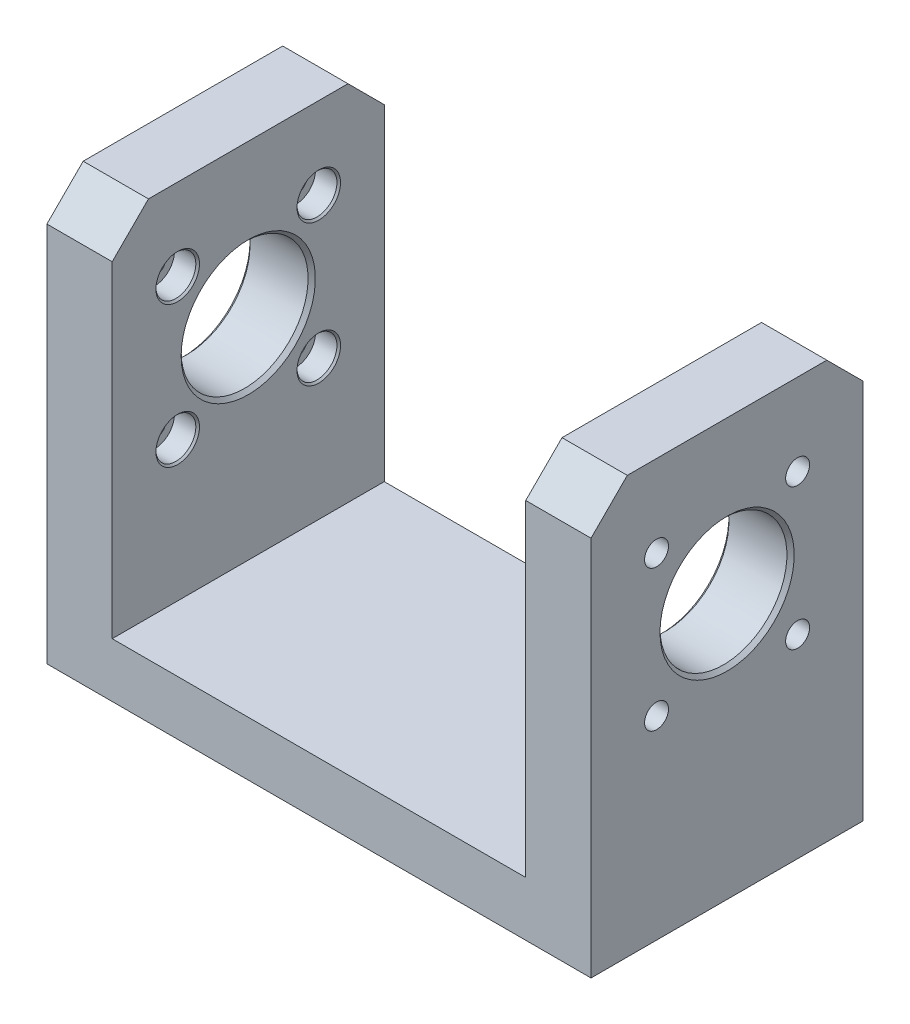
ISO-10303-21;
HEADER;
FILE_DESCRIPTION(('STEP AP214'),'2;1');
FILE_NAME('part.step','',(''),(''),'','','');
FILE_SCHEMA(('AUTOMOTIVE_DESIGN { 1 0 10303 214 1 1 1 1 }'));
ENDSEC;
DATA;
#1=APPLICATION_CONTEXT('core data for automotive mechanical design processes');
#2=APPLICATION_PROTOCOL_DEFINITION('international standard','automotive_design',2000,#1);
#3=PRODUCT_CONTEXT('',#1,'mechanical');
#4=PRODUCT('Part','Part','',(#3));
#5=PRODUCT_RELATED_PRODUCT_CATEGORY('part','',(#4));
#6=PRODUCT_DEFINITION_FORMATION('','',#4);
#7=PRODUCT_DEFINITION_CONTEXT('part definition',#1,'design');
#8=PRODUCT_DEFINITION('design','',#6,#7);
#9=PRODUCT_DEFINITION_SHAPE('','',#8);
#10=(LENGTH_UNIT() NAMED_UNIT(*) SI_UNIT(.MILLI.,.METRE.));
#11=(NAMED_UNIT(*) PLANE_ANGLE_UNIT() SI_UNIT($,.RADIAN.));
#12=(NAMED_UNIT(*) SI_UNIT($,.STERADIAN.) SOLID_ANGLE_UNIT());
#13=UNCERTAINTY_MEASURE_WITH_UNIT(LENGTH_MEASURE(1.E-05),#10,'distance_accuracy_value','');
#14=(GEOMETRIC_REPRESENTATION_CONTEXT(3) GLOBAL_UNCERTAINTY_ASSIGNED_CONTEXT((#13)) GLOBAL_UNIT_ASSIGNED_CONTEXT((#10,
#11,#12)) REPRESENTATION_CONTEXT('',''));
#15=CARTESIAN_POINT('',(0.,0.,0.));
#16=DIRECTION('',(0.,0.,1.));
#17=DIRECTION('',(1.,0.,0.));
#18=AXIS2_PLACEMENT_3D('',#15,#16,#17);
#19=CARTESIAN_POINT('',(75.,15.,37.5));
#20=DIRECTION('',(-1.,0.,0.));
#21=DIRECTION('',(0.,0.,1.));
#22=AXIS2_PLACEMENT_3D('',#19,#20,#21);
#23=PLANE('',#22);
#24=CARTESIAN_POINT('',(75.,73.,0.));
#25=DIRECTION('',(-1.,0.,0.));
#26=DIRECTION('',(0.,0.,1.));
#27=AXIS2_PLACEMENT_3D('',#24,#25,#26);
#28=CIRCLE('',#27,18.5000000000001);
#29=CARTESIAN_POINT('',(75.,73.,18.5000000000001));
#30=VERTEX_POINT('',#29);
#31=EDGE_CURVE('E394',#30,#30,#28,.T.);
#32=ORIENTED_EDGE('',*,*,#31,.T.);
#33=EDGE_LOOP('',(#32));
#34=FACE_BOUND('',#33,.T.);
#35=CARTESIAN_POINT('',(75.,53.5545635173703,-19.4454364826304));
#36=DIRECTION('',(-1.,0.,0.));
#37=DIRECTION('',(0.,0.,1.));
#38=AXIS2_PLACEMENT_3D('',#35,#36,#37);
#39=CIRCLE('',#38,3.3);
#40=CARTESIAN_POINT('',(75.,53.5545635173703,-16.1454364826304));
#41=VERTEX_POINT('',#40);
#42=EDGE_CURVE('E378',#41,#41,#39,.T.);
#43=ORIENTED_EDGE('',*,*,#42,.T.);
#44=EDGE_LOOP('',(#43));
#45=FACE_BOUND('',#44,.T.);
#46=CARTESIAN_POINT('',(75.,53.5545635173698,19.44543648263));
#47=DIRECTION('',(-1.,0.,0.));
#48=DIRECTION('',(0.,0.,1.));
#49=AXIS2_PLACEMENT_3D('',#46,#47,#48);
#50=CIRCLE('',#49,3.3);
#51=CARTESIAN_POINT('',(75.,53.5545635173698,22.74543648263));
#52=VERTEX_POINT('',#51);
#53=EDGE_CURVE('E543',#52,#52,#50,.T.);
#54=ORIENTED_EDGE('',*,*,#53,.T.);
#55=EDGE_LOOP('',(#54));
#56=FACE_BOUND('',#55,.T.);
#57=CARTESIAN_POINT('',(75.,92.4454364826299,19.4454364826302));
#58=DIRECTION('',(-1.,0.,0.));
#59=DIRECTION('',(0.,0.,1.));
#60=AXIS2_PLACEMENT_3D('',#57,#58,#59);
#61=CIRCLE('',#60,3.30000000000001);
#62=CARTESIAN_POINT('',(75.,92.4454364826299,22.7454364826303));
#63=VERTEX_POINT('',#62);
#64=EDGE_CURVE('E528',#63,#63,#61,.T.);
#65=ORIENTED_EDGE('',*,*,#64,.T.);
#66=EDGE_LOOP('',(#65));
#67=FACE_BOUND('',#66,.T.);
#68=CARTESIAN_POINT('',(75.,92.4454364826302,-19.4454364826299));
#69=DIRECTION('',(-1.,0.,0.));
#70=DIRECTION('',(0.,0.,1.));
#71=AXIS2_PLACEMENT_3D('',#68,#69,#70);
#72=CIRCLE('',#71,3.30000000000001);
#73=CARTESIAN_POINT('',(75.,92.4454364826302,-16.1454364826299));
#74=VERTEX_POINT('',#73);
#75=EDGE_CURVE('E506',#74,#74,#72,.T.);
#76=ORIENTED_EDGE('',*,*,#75,.T.);
#77=EDGE_LOOP('',(#76));
#78=FACE_BOUND('',#77,.T.);
#79=DIRECTION('',(0.,-1.,0.));
#80=VECTOR('',#79,1.);
#81=CARTESIAN_POINT('',(75.,15.,-37.5));
#82=LINE('',#81,#80);
#83=CARTESIAN_POINT('',(75.,105.,-37.5));
#84=VERTEX_POINT('',#83);
#85=CARTESIAN_POINT('',(75.,0.,-37.5));
#86=VERTEX_POINT('',#85);
#87=EDGE_CURVE('E315',#84,#86,#82,.T.);
#88=ORIENTED_EDGE('',*,*,#87,.F.);
#89=DIRECTION('',(0.,0.707106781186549,0.707106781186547));
#90=VECTOR('',#89,1.);
#91=CARTESIAN_POINT('',(75.,105.,-37.5));
#92=LINE('',#91,#90);
#93=CARTESIAN_POINT('',(75.,115.,-27.5));
#94=VERTEX_POINT('',#93);
#95=EDGE_CURVE('E415',#84,#94,#92,.T.);
#96=ORIENTED_EDGE('',*,*,#95,.T.);
#97=DIRECTION('',(0.,0.,1.));
#98=VECTOR('',#97,1.);
#99=CARTESIAN_POINT('',(75.,115.,-37.5));
#100=LINE('',#99,#98);
#101=CARTESIAN_POINT('',(75.,115.,27.5000000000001));
#102=VERTEX_POINT('',#101);
#103=EDGE_CURVE('E420',#94,#102,#100,.T.);
#104=ORIENTED_EDGE('',*,*,#103,.T.);
#105=DIRECTION('',(0.,-0.707106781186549,0.707106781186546));
#106=VECTOR('',#105,1.);
#107=CARTESIAN_POINT('',(75.,105.,37.5));
#108=LINE('',#107,#106);
#109=CARTESIAN_POINT('',(75.,105.,37.5));
#110=VERTEX_POINT('',#109);
#111=EDGE_CURVE('E404',#102,#110,#108,.T.);
#112=ORIENTED_EDGE('',*,*,#111,.T.);
#113=DIRECTION('',(0.,-1.,0.));
#114=VECTOR('',#113,1.);
#115=CARTESIAN_POINT('',(75.,15.,37.5));
#116=LINE('',#115,#114);
#117=CARTESIAN_POINT('',(75.,0.,37.5));
#118=VERTEX_POINT('',#117);
#119=EDGE_CURVE('E318',#110,#118,#116,.T.);
#120=ORIENTED_EDGE('',*,*,#119,.T.);
#121=DIRECTION('',(0.,0.,-1.));
#122=VECTOR('',#121,1.);
#123=CARTESIAN_POINT('',(75.,0.,37.5));
#124=LINE('',#123,#122);
#125=EDGE_CURVE('E306',#118,#86,#124,.T.);
#126=ORIENTED_EDGE('',*,*,#125,.T.);
#127=EDGE_LOOP('',(#88,#96,#104,#112,#120,#126));
#128=FACE_BOUND('',#127,.T.);
#129=ADVANCED_FACE('F45',(#34,#45,#56,#67,#78,#128),#23,.F.);
#130=CARTESIAN_POINT('',(57.,115.,-37.5));
#131=DIRECTION('',(-1.,0.,0.));
#132=DIRECTION('',(0.,0.,1.));
#133=AXIS2_PLACEMENT_3D('',#130,#131,#132);
#134=PLANE('',#133);
#135=CARTESIAN_POINT('',(57.,73.,0.));
#136=DIRECTION('',(-1.,0.,0.));
#137=DIRECTION('',(0.,0.,1.));
#138=AXIS2_PLACEMENT_3D('',#135,#136,#137);
#139=CIRCLE('',#138,18.5);
#140=CARTESIAN_POINT('',(57.,73.,18.5));
#141=VERTEX_POINT('',#140);
#142=EDGE_CURVE('E11',#141,#141,#139,.F.);
#143=ORIENTED_EDGE('',*,*,#142,.T.);
#144=EDGE_LOOP('',(#143));
#145=FACE_BOUND('',#144,.T.);
#146=CARTESIAN_POINT('',(57.,53.5545635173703,-19.4454364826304));
#147=DIRECTION('',(-1.,0.,0.));
#148=DIRECTION('',(0.,0.,1.));
#149=AXIS2_PLACEMENT_3D('',#146,#147,#148);
#150=CIRCLE('',#149,6.);
#151=CARTESIAN_POINT('',(57.,53.5545635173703,-13.4454364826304));
#152=VERTEX_POINT('',#151);
#153=EDGE_CURVE('E380',#152,#152,#150,.T.);
#154=ORIENTED_EDGE('',*,*,#153,.F.);
#155=EDGE_LOOP('',(#154));
#156=FACE_BOUND('',#155,.T.);
#157=CARTESIAN_POINT('',(57.,53.5545635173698,19.4454364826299));
#158=DIRECTION('',(-1.,0.,0.));
#159=DIRECTION('',(0.,0.,1.));
#160=AXIS2_PLACEMENT_3D('',#157,#158,#159);
#161=CIRCLE('',#160,6.);
#162=CARTESIAN_POINT('',(57.,53.5545635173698,25.4454364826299));
#163=VERTEX_POINT('',#162);
#164=EDGE_CURVE('E392',#163,#163,#161,.T.);
#165=ORIENTED_EDGE('',*,*,#164,.F.);
#166=EDGE_LOOP('',(#165));
#167=FACE_BOUND('',#166,.T.);
#168=CARTESIAN_POINT('',(57.,92.4454364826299,19.4454364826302));
#169=DIRECTION('',(-1.,0.,0.));
#170=DIRECTION('',(0.,0.,1.));
#171=AXIS2_PLACEMENT_3D('',#168,#169,#170);
#172=CIRCLE('',#171,6.00000000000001);
#173=CARTESIAN_POINT('',(57.,92.4454364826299,25.4454364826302));
#174=VERTEX_POINT('',#173);
#175=EDGE_CURVE('E540',#174,#174,#172,.T.);
#176=ORIENTED_EDGE('',*,*,#175,.F.);
#177=EDGE_LOOP('',(#176));
#178=FACE_BOUND('',#177,.T.);
#179=CARTESIAN_POINT('',(57.,92.4454364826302,-19.4454364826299));
#180=DIRECTION('',(-1.,0.,0.));
#181=DIRECTION('',(0.,0.,1.));
#182=AXIS2_PLACEMENT_3D('',#179,#180,#181);
#183=CIRCLE('',#182,6.00000000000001);
#184=CARTESIAN_POINT('',(57.,92.4454364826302,-13.4454364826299));
#185=VERTEX_POINT('',#184);
#186=EDGE_CURVE('E525',#185,#185,#183,.T.);
#187=ORIENTED_EDGE('',*,*,#186,.F.);
#188=EDGE_LOOP('',(#187));
#189=FACE_BOUND('',#188,.T.);
#190=DIRECTION('',(0.,0.,-1.));
#191=VECTOR('',#190,1.);
#192=CARTESIAN_POINT('',(57.,115.,-37.5));
#193=LINE('',#192,#191);
#194=CARTESIAN_POINT('',(57.,115.,27.5000000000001));
#195=VERTEX_POINT('',#194);
#196=CARTESIAN_POINT('',(57.,115.,-27.5));
#197=VERTEX_POINT('',#196);
#198=EDGE_CURVE('E505',#195,#197,#193,.T.);
#199=ORIENTED_EDGE('',*,*,#198,.T.);
#200=DIRECTION('',(0.,-0.707106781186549,-0.707106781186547));
#201=VECTOR('',#200,1.);
#202=CARTESIAN_POINT('',(57.,110.,-32.4999999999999));
#203=LINE('',#202,#201);
#204=CARTESIAN_POINT('',(57.,105.,-37.5));
#205=VERTEX_POINT('',#204);
#206=EDGE_CURVE('E405',#197,#205,#203,.T.);
#207=ORIENTED_EDGE('',*,*,#206,.T.);
#208=DIRECTION('',(0.,-1.,0.));
#209=VECTOR('',#208,1.);
#210=CARTESIAN_POINT('',(57.,115.,-37.5));
#211=LINE('',#210,#209);
#212=CARTESIAN_POINT('',(57.,15.,-37.5));
#213=VERTEX_POINT('',#212);
#214=EDGE_CURVE('E162',#205,#213,#211,.T.);
#215=ORIENTED_EDGE('',*,*,#214,.T.);
#216=DIRECTION('',(0.,0.,-1.));
#217=VECTOR('',#216,1.);
#218=CARTESIAN_POINT('',(57.,15.,-37.5));
#219=LINE('',#218,#217);
#220=CARTESIAN_POINT('',(57.,15.,37.5));
#221=VERTEX_POINT('',#220);
#222=EDGE_CURVE('E503',#221,#213,#219,.T.);
#223=ORIENTED_EDGE('',*,*,#222,.F.);
#224=DIRECTION('',(0.,-1.,0.));
#225=VECTOR('',#224,1.);
#226=CARTESIAN_POINT('',(57.,115.,37.5));
#227=LINE('',#226,#225);
#228=CARTESIAN_POINT('',(57.,105.,37.5));
#229=VERTEX_POINT('',#228);
#230=EDGE_CURVE('E363',#229,#221,#227,.T.);
#231=ORIENTED_EDGE('',*,*,#230,.F.);
#232=DIRECTION('',(0.,0.707106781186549,-0.707106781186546));
#233=VECTOR('',#232,1.);
#234=CARTESIAN_POINT('',(57.,147.5,-4.99999999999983));
#235=LINE('',#234,#233);
#236=EDGE_CURVE('E61',#229,#195,#235,.T.);
#237=ORIENTED_EDGE('',*,*,#236,.T.);
#238=EDGE_LOOP('',(#199,#207,#215,#223,#231,#237));
#239=FACE_BOUND('',#238,.T.);
#240=ADVANCED_FACE('F436',(#145,#156,#167,#178,#189,#239),#134,.T.);
#241=CARTESIAN_POINT('',(-75.,15.,37.5));
#242=DIRECTION('',(1.,0.,0.));
#243=DIRECTION('',(0.,0.,-1.));
#244=AXIS2_PLACEMENT_3D('',#241,#242,#243);
#245=PLANE('',#244);
#246=CARTESIAN_POINT('',(-75.,73.,0.));
#247=DIRECTION('',(1.,0.,0.));
#248=DIRECTION('',(0.,0.,-1.));
#249=AXIS2_PLACEMENT_3D('',#246,#247,#248);
#250=CIRCLE('',#249,18.5000000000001);
#251=CARTESIAN_POINT('',(-75.,73.,-18.5000000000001));
#252=VERTEX_POINT('',#251);
#253=EDGE_CURVE('E288',#252,#252,#250,.T.);
#254=ORIENTED_EDGE('',*,*,#253,.T.);
#255=EDGE_LOOP('',(#254));
#256=FACE_BOUND('',#255,.T.);
#257=CARTESIAN_POINT('',(-75.,53.5545635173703,-19.4454364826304));
#258=DIRECTION('',(1.,0.,0.));
#259=DIRECTION('',(0.,0.,-1.));
#260=AXIS2_PLACEMENT_3D('',#257,#258,#259);
#261=CIRCLE('',#260,3.3);
#262=CARTESIAN_POINT('',(-75.,53.5545635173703,-22.7454364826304));
#263=VERTEX_POINT('',#262);
#264=EDGE_CURVE('E180',#263,#263,#261,.T.);
#265=ORIENTED_EDGE('',*,*,#264,.T.);
#266=EDGE_LOOP('',(#265));
#267=FACE_BOUND('',#266,.T.);
#268=CARTESIAN_POINT('',(-75.,53.5545635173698,19.44543648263));
#269=DIRECTION('',(1.,0.,0.));
#270=DIRECTION('',(0.,0.,-1.));
#271=AXIS2_PLACEMENT_3D('',#268,#269,#270);
#272=CIRCLE('',#271,3.3);
#273=CARTESIAN_POINT('',(-75.,53.5545635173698,16.1454364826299));
#274=VERTEX_POINT('',#273);
#275=EDGE_CURVE('E199',#274,#274,#272,.T.);
#276=ORIENTED_EDGE('',*,*,#275,.T.);
#277=EDGE_LOOP('',(#276));
#278=FACE_BOUND('',#277,.T.);
#279=CARTESIAN_POINT('',(-75.,92.4454364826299,19.4454364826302));
#280=DIRECTION('',(1.,0.,0.));
#281=DIRECTION('',(0.,0.,-1.));
#282=AXIS2_PLACEMENT_3D('',#279,#280,#281);
#283=CIRCLE('',#282,3.30000000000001);
#284=CARTESIAN_POINT('',(-75.,92.4454364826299,16.1454364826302));
#285=VERTEX_POINT('',#284);
#286=EDGE_CURVE('E215',#285,#285,#283,.T.);
#287=ORIENTED_EDGE('',*,*,#286,.T.);
#288=EDGE_LOOP('',(#287));
#289=FACE_BOUND('',#288,.T.);
#290=CARTESIAN_POINT('',(-75.,92.4454364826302,-19.4454364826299));
#291=DIRECTION('',(1.,0.,0.));
#292=DIRECTION('',(0.,0.,-1.));
#293=AXIS2_PLACEMENT_3D('',#290,#291,#292);
#294=CIRCLE('',#293,3.30000000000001);
#295=CARTESIAN_POINT('',(-75.,92.4454364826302,-22.74543648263));
#296=VERTEX_POINT('',#295);
#297=EDGE_CURVE('E232',#296,#296,#294,.T.);
#298=ORIENTED_EDGE('',*,*,#297,.T.);
#299=EDGE_LOOP('',(#298));
#300=FACE_BOUND('',#299,.T.);
#301=DIRECTION('',(0.,0.,1.));
#302=VECTOR('',#301,1.);
#303=CARTESIAN_POINT('',(-75.,115.,-37.5));
#304=LINE('',#303,#302);
#305=CARTESIAN_POINT('',(-75.,115.,-27.5));
#306=VERTEX_POINT('',#305);
#307=CARTESIAN_POINT('',(-75.,115.,27.5));
#308=VERTEX_POINT('',#307);
#309=EDGE_CURVE('E236',#306,#308,#304,.T.);
#310=ORIENTED_EDGE('',*,*,#309,.F.);
#311=DIRECTION('',(0.,-0.707106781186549,-0.707106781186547));
#312=VECTOR('',#311,1.);
#313=CARTESIAN_POINT('',(-75.,115.,-27.5));
#314=LINE('',#313,#312);
#315=CARTESIAN_POINT('',(-75.,105.,-37.5));
#316=VERTEX_POINT('',#315);
#317=EDGE_CURVE('E263',#306,#316,#314,.T.);
#318=ORIENTED_EDGE('',*,*,#317,.T.);
#319=DIRECTION('',(0.,-1.,0.));
#320=VECTOR('',#319,1.);
#321=CARTESIAN_POINT('',(-75.,15.,-37.5));
#322=LINE('',#321,#320);
#323=CARTESIAN_POINT('',(-75.,0.,-37.5));
#324=VERTEX_POINT('',#323);
#325=EDGE_CURVE('E296',#316,#324,#322,.T.);
#326=ORIENTED_EDGE('',*,*,#325,.T.);
#327=DIRECTION('',(0.,0.,1.));
#328=VECTOR('',#327,1.);
#329=CARTESIAN_POINT('',(-75.,0.,37.5));
#330=LINE('',#329,#328);
#331=CARTESIAN_POINT('',(-75.,0.,37.5));
#332=VERTEX_POINT('',#331);
#333=EDGE_CURVE('E270',#324,#332,#330,.T.);
#334=ORIENTED_EDGE('',*,*,#333,.T.);
#335=DIRECTION('',(0.,-1.,0.));
#336=VECTOR('',#335,1.);
#337=CARTESIAN_POINT('',(-75.,15.,37.5));
#338=LINE('',#337,#336);
#339=CARTESIAN_POINT('',(-75.,105.,37.5));
#340=VERTEX_POINT('',#339);
#341=EDGE_CURVE('E320',#340,#332,#338,.T.);
#342=ORIENTED_EDGE('',*,*,#341,.F.);
#343=DIRECTION('',(0.,0.707106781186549,-0.707106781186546));
#344=VECTOR('',#343,1.);
#345=CARTESIAN_POINT('',(-75.,115.,27.5000000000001));
#346=LINE('',#345,#344);
#347=EDGE_CURVE('E332',#340,#308,#346,.T.);
#348=ORIENTED_EDGE('',*,*,#347,.T.);
#349=EDGE_LOOP('',(#310,#318,#326,#334,#342,#348));
#350=FACE_BOUND('',#349,.T.);
#351=ADVANCED_FACE('F338',(#256,#267,#278,#289,#300,#350),#245,.F.);
#352=CARTESIAN_POINT('',(75.,15.,37.5));
#353=DIRECTION('',(0.,0.,-1.));
#354=DIRECTION('',(-1.,0.,0.));
#355=AXIS2_PLACEMENT_3D('',#352,#353,#354);
#356=PLANE('',#355);
#357=ORIENTED_EDGE('',*,*,#119,.F.);
#358=DIRECTION('',(-1.,0.,0.));
#359=VECTOR('',#358,1.);
#360=CARTESIAN_POINT('',(57.,105.,37.5));
#361=LINE('',#360,#359);
#362=EDGE_CURVE('E397',#110,#229,#361,.T.);
#363=ORIENTED_EDGE('',*,*,#362,.T.);
#364=ORIENTED_EDGE('',*,*,#230,.T.);
#365=DIRECTION('',(1.,0.,0.));
#366=VECTOR('',#365,1.);
#367=CARTESIAN_POINT('',(75.,15.,37.5));
#368=LINE('',#367,#366);
#369=CARTESIAN_POINT('',(-57.,15.,37.5));
#370=VERTEX_POINT('',#369);
#371=EDGE_CURVE('E251',#370,#221,#368,.T.);
#372=ORIENTED_EDGE('',*,*,#371,.F.);
#373=DIRECTION('',(0.,-1.,0.));
#374=VECTOR('',#373,1.);
#375=CARTESIAN_POINT('',(-57.,115.,37.5));
#376=LINE('',#375,#374);
#377=CARTESIAN_POINT('',(-57.,105.,37.5));
#378=VERTEX_POINT('',#377);
#379=EDGE_CURVE('E262',#378,#370,#376,.T.);
#380=ORIENTED_EDGE('',*,*,#379,.F.);
#381=DIRECTION('',(-1.,0.,0.));
#382=VECTOR('',#381,1.);
#383=CARTESIAN_POINT('',(-75.,105.,37.5));
#384=LINE('',#383,#382);
#385=EDGE_CURVE('E274',#378,#340,#384,.T.);
#386=ORIENTED_EDGE('',*,*,#385,.T.);
#387=ORIENTED_EDGE('',*,*,#341,.T.);
#388=DIRECTION('',(1.,0.,0.));
#389=VECTOR('',#388,1.);
#390=CARTESIAN_POINT('',(75.,0.,37.5));
#391=LINE('',#390,#389);
#392=EDGE_CURVE('E302',#332,#118,#391,.T.);
#393=ORIENTED_EDGE('',*,*,#392,.T.);
#394=EDGE_LOOP('',(#357,#363,#364,#372,#380,#386,#387,#393));
#395=FACE_BOUND('',#394,.T.);
#396=ADVANCED_FACE('F360',(#395),#356,.F.);
#397=CARTESIAN_POINT('',(75.,15.,-37.5));
#398=DIRECTION('',(0.,0.,1.));
#399=DIRECTION('',(1.,0.,0.));
#400=AXIS2_PLACEMENT_3D('',#397,#398,#399);
#401=PLANE('',#400);
#402=CARTESIAN_POINT('',(-61.,95.,-37.5));
#403=DIRECTION('',(0.,0.,-1.));
#404=DIRECTION('',(-1.,0.,0.));
#405=AXIS2_PLACEMENT_3D('',#402,#403,#404);
#406=CIRCLE('',#405,1.65);
#407=CARTESIAN_POINT('',(-62.65,95.,-37.5));
#408=VERTEX_POINT('',#407);
#409=EDGE_CURVE('E155',#408,#408,#406,.T.);
#410=ORIENTED_EDGE('',*,*,#409,.F.);
#411=EDGE_LOOP('',(#410));
#412=FACE_BOUND('',#411,.T.);
#413=CARTESIAN_POINT('',(-61.,25.,-37.5));
#414=DIRECTION('',(0.,0.,-1.));
#415=DIRECTION('',(-1.,0.,0.));
#416=AXIS2_PLACEMENT_3D('',#413,#414,#415);
#417=CIRCLE('',#416,1.65);
#418=CARTESIAN_POINT('',(-62.65,25.,-37.5));
#419=VERTEX_POINT('',#418);
#420=EDGE_CURVE('E154',#419,#419,#417,.T.);
#421=ORIENTED_EDGE('',*,*,#420,.F.);
#422=EDGE_LOOP('',(#421));
#423=FACE_BOUND('',#422,.T.);
#424=ORIENTED_EDGE('',*,*,#214,.F.);
#425=DIRECTION('',(1.,0.,0.));
#426=VECTOR('',#425,1.);
#427=CARTESIAN_POINT('',(75.,105.,-37.5));
#428=LINE('',#427,#426);
#429=EDGE_CURVE('E292',#205,#84,#428,.T.);
#430=ORIENTED_EDGE('',*,*,#429,.T.);
#431=ORIENTED_EDGE('',*,*,#87,.T.);
#432=DIRECTION('',(-1.,0.,0.));
#433=VECTOR('',#432,1.);
#434=CARTESIAN_POINT('',(75.,0.,-37.5));
#435=LINE('',#434,#433);
#436=EDGE_CURVE('E309',#86,#324,#435,.T.);
#437=ORIENTED_EDGE('',*,*,#436,.T.);
#438=ORIENTED_EDGE('',*,*,#325,.F.);
#439=DIRECTION('',(1.,0.,0.));
#440=VECTOR('',#439,1.);
#441=CARTESIAN_POINT('',(-57.,105.,-37.5));
#442=LINE('',#441,#440);
#443=CARTESIAN_POINT('',(-57.,105.,-37.5));
#444=VERTEX_POINT('',#443);
#445=EDGE_CURVE('E265',#316,#444,#442,.T.);
#446=ORIENTED_EDGE('',*,*,#445,.T.);
#447=DIRECTION('',(0.,-1.,0.));
#448=VECTOR('',#447,1.);
#449=CARTESIAN_POINT('',(-57.,115.,-37.5));
#450=LINE('',#449,#448);
#451=CARTESIAN_POINT('',(-57.,15.,-37.5));
#452=VERTEX_POINT('',#451);
#453=EDGE_CURVE('E242',#444,#452,#450,.T.);
#454=ORIENTED_EDGE('',*,*,#453,.T.);
#455=DIRECTION('',(-1.,0.,0.));
#456=VECTOR('',#455,1.);
#457=CARTESIAN_POINT('',(75.,15.,-37.5));
#458=LINE('',#457,#456);
#459=EDGE_CURVE('E293',#213,#452,#458,.T.);
#460=ORIENTED_EDGE('',*,*,#459,.F.);
#461=EDGE_LOOP('',(#424,#430,#431,#437,#438,#446,#454,#460));
#462=FACE_BOUND('',#461,.T.);
#463=ADVANCED_FACE('F344',(#412,#423,#462),#401,.F.);
#464=CARTESIAN_POINT('',(-75.,15.,-37.5));
#465=DIRECTION('',(0.,1.,0.));
#466=DIRECTION('',(0.,0.,1.));
#467=AXIS2_PLACEMENT_3D('',#464,#465,#466);
#468=PLANE('',#467);
#469=ORIENTED_EDGE('',*,*,#222,.T.);
#470=ORIENTED_EDGE('',*,*,#459,.T.);
#471=DIRECTION('',(0.,0.,-1.));
#472=VECTOR('',#471,1.);
#473=CARTESIAN_POINT('',(-57.,15.,-37.5));
#474=LINE('',#473,#472);
#475=EDGE_CURVE('E235',#370,#452,#474,.T.);
#476=ORIENTED_EDGE('',*,*,#475,.F.);
#477=ORIENTED_EDGE('',*,*,#371,.T.);
#478=EDGE_LOOP('',(#469,#470,#476,#477));
#479=FACE_BOUND('',#478,.T.);
#480=ADVANCED_FACE('F495',(#479),#468,.T.);
#481=CARTESIAN_POINT('',(-75.,0.,-37.5));
#482=DIRECTION('',(0.,1.,0.));
#483=DIRECTION('',(0.,0.,1.));
#484=AXIS2_PLACEMENT_3D('',#481,#482,#483);
#485=PLANE('',#484);
#486=ORIENTED_EDGE('',*,*,#333,.F.);
#487=ORIENTED_EDGE('',*,*,#436,.F.);
#488=ORIENTED_EDGE('',*,*,#125,.F.);
#489=ORIENTED_EDGE('',*,*,#392,.F.);
#490=EDGE_LOOP('',(#486,#487,#488,#489));
#491=FACE_BOUND('',#490,.T.);
#492=ADVANCED_FACE('F493',(#491),#485,.F.);
#493=CARTESIAN_POINT('',(-57.,115.,-37.5));
#494=DIRECTION('',(-1.,0.,0.));
#495=DIRECTION('',(0.,0.,1.));
#496=AXIS2_PLACEMENT_3D('',#493,#494,#495);
#497=PLANE('',#496);
#498=CARTESIAN_POINT('',(-57.,73.,0.));
#499=DIRECTION('',(-1.,0.,0.));
#500=DIRECTION('',(0.,0.,1.));
#501=AXIS2_PLACEMENT_3D('',#498,#499,#500);
#502=CIRCLE('',#501,18.5);
#503=CARTESIAN_POINT('',(-57.,73.,18.5));
#504=VERTEX_POINT('',#503);
#505=EDGE_CURVE('E284',#504,#504,#502,.T.);
#506=ORIENTED_EDGE('',*,*,#505,.T.);
#507=EDGE_LOOP('',(#506));
#508=FACE_BOUND('',#507,.T.);
#509=CARTESIAN_POINT('',(-57.,53.5545635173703,-19.4454364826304));
#510=DIRECTION('',(1.,0.,0.));
#511=DIRECTION('',(0.,0.,-1.));
#512=AXIS2_PLACEMENT_3D('',#509,#510,#511);
#513=CIRCLE('',#512,6.);
#514=CARTESIAN_POINT('',(-57.,53.5545635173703,-25.4454364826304));
#515=VERTEX_POINT('',#514);
#516=EDGE_CURVE('E168',#515,#515,#513,.T.);
#517=ORIENTED_EDGE('',*,*,#516,.F.);
#518=EDGE_LOOP('',(#517));
#519=FACE_BOUND('',#518,.T.);
#520=CARTESIAN_POINT('',(-57.,53.5545635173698,19.4454364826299));
#521=DIRECTION('',(1.,0.,0.));
#522=DIRECTION('',(0.,0.,-1.));
#523=AXIS2_PLACEMENT_3D('',#520,#521,#522);
#524=CIRCLE('',#523,6.);
#525=CARTESIAN_POINT('',(-57.,53.5545635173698,13.4454364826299));
#526=VERTEX_POINT('',#525);
#527=EDGE_CURVE('E183',#526,#526,#524,.T.);
#528=ORIENTED_EDGE('',*,*,#527,.F.);
#529=EDGE_LOOP('',(#528));
#530=FACE_BOUND('',#529,.T.);
#531=CARTESIAN_POINT('',(-57.,92.4454364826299,19.4454364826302));
#532=DIRECTION('',(1.,0.,0.));
#533=DIRECTION('',(0.,0.,-1.));
#534=AXIS2_PLACEMENT_3D('',#531,#532,#533);
#535=CIRCLE('',#534,6.00000000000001);
#536=CARTESIAN_POINT('',(-57.,92.4454364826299,13.4454364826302));
#537=VERTEX_POINT('',#536);
#538=EDGE_CURVE('E203',#537,#537,#535,.T.);
#539=ORIENTED_EDGE('',*,*,#538,.F.);
#540=EDGE_LOOP('',(#539));
#541=FACE_BOUND('',#540,.T.);
#542=CARTESIAN_POINT('',(-57.,92.4454364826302,-19.4454364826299));
#543=DIRECTION('',(1.,0.,0.));
#544=DIRECTION('',(0.,0.,-1.));
#545=AXIS2_PLACEMENT_3D('',#542,#543,#544);
#546=CIRCLE('',#545,6.00000000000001);
#547=CARTESIAN_POINT('',(-57.,92.4454364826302,-25.4454364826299));
#548=VERTEX_POINT('',#547);
#549=EDGE_CURVE('E218',#548,#548,#546,.T.);
#550=ORIENTED_EDGE('',*,*,#549,.F.);
#551=EDGE_LOOP('',(#550));
#552=FACE_BOUND('',#551,.T.);
#553=ORIENTED_EDGE('',*,*,#453,.F.);
#554=DIRECTION('',(0.,0.707106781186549,0.707106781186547));
#555=VECTOR('',#554,1.);
#556=CARTESIAN_POINT('',(-57.,115.,-27.5));
#557=LINE('',#556,#555);
#558=CARTESIAN_POINT('',(-57.,115.,-27.5));
#559=VERTEX_POINT('',#558);
#560=EDGE_CURVE('E272',#444,#559,#557,.T.);
#561=ORIENTED_EDGE('',*,*,#560,.T.);
#562=DIRECTION('',(0.,0.,-1.));
#563=VECTOR('',#562,1.);
#564=CARTESIAN_POINT('',(-57.,115.,-37.5));
#565=LINE('',#564,#563);
#566=CARTESIAN_POINT('',(-57.,115.,27.5));
#567=VERTEX_POINT('',#566);
#568=EDGE_CURVE('E239',#567,#559,#565,.T.);
#569=ORIENTED_EDGE('',*,*,#568,.F.);
#570=DIRECTION('',(0.,-0.707106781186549,0.707106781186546));
#571=VECTOR('',#570,1.);
#572=CARTESIAN_POINT('',(-57.,115.,27.5000000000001));
#573=LINE('',#572,#571);
#574=EDGE_CURVE('E267',#567,#378,#573,.T.);
#575=ORIENTED_EDGE('',*,*,#574,.T.);
#576=ORIENTED_EDGE('',*,*,#379,.T.);
#577=ORIENTED_EDGE('',*,*,#475,.T.);
#578=EDGE_LOOP('',(#553,#561,#569,#575,#576,#577));
#579=FACE_BOUND('',#578,.T.);
#580=ADVANCED_FACE('F351',(#508,#519,#530,#541,#552,#579),#497,.F.);
#581=CARTESIAN_POINT('',(-75.,115.,-37.5));
#582=DIRECTION('',(0.,1.,0.));
#583=DIRECTION('',(0.,0.,1.));
#584=AXIS2_PLACEMENT_3D('',#581,#582,#583);
#585=PLANE('',#584);
#586=ORIENTED_EDGE('',*,*,#568,.T.);
#587=DIRECTION('',(-1.,0.,0.));
#588=VECTOR('',#587,1.);
#589=CARTESIAN_POINT('',(-75.,115.,-27.5));
#590=LINE('',#589,#588);
#591=EDGE_CURVE('E327',#559,#306,#590,.T.);
#592=ORIENTED_EDGE('',*,*,#591,.T.);
#593=ORIENTED_EDGE('',*,*,#309,.T.);
#594=DIRECTION('',(1.,0.,0.));
#595=VECTOR('',#594,1.);
#596=CARTESIAN_POINT('',(-57.,115.,27.5000000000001));
#597=LINE('',#596,#595);
#598=EDGE_CURVE('E322',#308,#567,#597,.T.);
#599=ORIENTED_EDGE('',*,*,#598,.T.);
#600=EDGE_LOOP('',(#586,#592,#593,#599));
#601=FACE_BOUND('',#600,.T.);
#602=ADVANCED_FACE('F352',(#601),#585,.T.);
#603=CARTESIAN_POINT('',(75.001025,73.,0.));
#604=DIRECTION('',(-1.,0.,0.));
#605=DIRECTION('',(0.,0.,1.));
#606=AXIS2_PLACEMENT_3D('',#603,#604,#605);
#607=CYLINDRICAL_SURFACE('',#606,17.5);
#608=CARTESIAN_POINT('',(-58.,73.,0.));
#609=DIRECTION('',(-1.,0.,0.));
#610=DIRECTION('',(0.,0.,1.));
#611=AXIS2_PLACEMENT_3D('',#608,#609,#610);
#612=CIRCLE('',#611,17.5);
#613=CARTESIAN_POINT('',(-58.,73.,17.5));
#614=VERTEX_POINT('',#613);
#615=EDGE_CURVE('E280',#614,#614,#612,.F.);
#616=ORIENTED_EDGE('',*,*,#615,.T.);
#617=EDGE_LOOP('',(#616));
#618=FACE_BOUND('',#617,.T.);
#619=CARTESIAN_POINT('',(-73.9999999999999,73.,0.));
#620=DIRECTION('',(1.,0.,0.));
#621=DIRECTION('',(0.,0.,-1.));
#622=AXIS2_PLACEMENT_3D('',#619,#620,#621);
#623=CIRCLE('',#622,17.5);
#624=CARTESIAN_POINT('',(-73.9999999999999,73.,-17.5));
#625=VERTEX_POINT('',#624);
#626=EDGE_CURVE('E276',#625,#625,#623,.F.);
#627=ORIENTED_EDGE('',*,*,#626,.T.);
#628=EDGE_LOOP('',(#627));
#629=FACE_BOUND('',#628,.T.);
#630=ADVANCED_FACE('F476',(#618,#629),#607,.F.);
#631=CARTESIAN_POINT('',(-57.,92.4454364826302,-19.4454364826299));
#632=DIRECTION('',(1.,0.,0.));
#633=DIRECTION('',(0.,0.,-1.));
#634=AXIS2_PLACEMENT_3D('',#631,#632,#633);
#635=CYLINDRICAL_SURFACE('',#634,3.3);
#636=ORIENTED_EDGE('',*,*,#297,.F.);
#637=EDGE_LOOP('',(#636));
#638=FACE_BOUND('',#637,.T.);
#639=CARTESIAN_POINT('',(-63.4,92.4454364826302,-19.4454364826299));
#640=DIRECTION('',(1.,0.,0.));
#641=DIRECTION('',(0.,0.,-1.));
#642=AXIS2_PLACEMENT_3D('',#639,#640,#641);
#643=CIRCLE('',#642,3.3);
#644=CARTESIAN_POINT('',(-63.4,92.4454364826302,-22.7454364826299));
#645=VERTEX_POINT('',#644);
#646=EDGE_CURVE('E229',#645,#645,#643,.T.);
#647=ORIENTED_EDGE('',*,*,#646,.T.);
#648=EDGE_LOOP('',(#647));
#649=FACE_BOUND('',#648,.T.);
#650=ADVANCED_FACE('F478',(#638,#649),#635,.F.);
#651=CARTESIAN_POINT('',(-63.4,97.9454364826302,-19.4454364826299));
#652=DIRECTION('',(-1.,0.,0.));
#653=DIRECTION('',(0.,0.,1.));
#654=AXIS2_PLACEMENT_3D('',#651,#652,#653);
#655=PLANE('',#654);
#656=ORIENTED_EDGE('',*,*,#646,.F.);
#657=EDGE_LOOP('',(#656));
#658=FACE_BOUND('',#657,.T.);
#659=CARTESIAN_POINT('',(-63.4,92.4454364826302,-19.4454364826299));
#660=DIRECTION('',(1.,0.,0.));
#661=DIRECTION('',(0.,0.,-1.));
#662=AXIS2_PLACEMENT_3D('',#659,#660,#661);
#663=CIRCLE('',#662,5.49999999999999);
#664=CARTESIAN_POINT('',(-63.4,92.4454364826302,-24.9454364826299));
#665=VERTEX_POINT('',#664);
#666=EDGE_CURVE('E226',#665,#665,#663,.T.);
#667=ORIENTED_EDGE('',*,*,#666,.T.);
#668=EDGE_LOOP('',(#667));
#669=FACE_BOUND('',#668,.T.);
#670=ADVANCED_FACE('F485',(#658,#669),#655,.F.);
#671=CARTESIAN_POINT('',(-57.,92.4454364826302,-19.4454364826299));
#672=DIRECTION('',(1.,0.,0.));
#673=DIRECTION('',(0.,0.,-1.));
#674=AXIS2_PLACEMENT_3D('',#671,#672,#673);
#675=CYLINDRICAL_SURFACE('',#674,5.5);
#676=ORIENTED_EDGE('',*,*,#666,.F.);
#677=EDGE_LOOP('',(#676));
#678=FACE_BOUND('',#677,.T.);
#679=CARTESIAN_POINT('',(-57.5,92.4454364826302,-19.4454364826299));
#680=DIRECTION('',(1.,0.,0.));
#681=DIRECTION('',(0.,0.,-1.));
#682=AXIS2_PLACEMENT_3D('',#679,#680,#681);
#683=CIRCLE('',#682,5.50000000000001);
#684=CARTESIAN_POINT('',(-57.5,92.4454364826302,-24.9454364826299));
#685=VERTEX_POINT('',#684);
#686=EDGE_CURVE('E222',#685,#685,#683,.T.);
#687=ORIENTED_EDGE('',*,*,#686,.T.);
#688=EDGE_LOOP('',(#687));
#689=FACE_BOUND('',#688,.T.);
#690=ADVANCED_FACE('F654',(#678,#689),#675,.F.);
#691=CARTESIAN_POINT('',(-57.,92.4454364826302,-19.4454364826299));
#692=DIRECTION('',(1.,0.,0.));
#693=DIRECTION('',(0.,0.,-1.));
#694=AXIS2_PLACEMENT_3D('',#691,#692,#693);
#695=CONICAL_SURFACE('',#694,6.00000000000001,0.785398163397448);
#696=ORIENTED_EDGE('',*,*,#686,.F.);
#697=EDGE_LOOP('',(#696));
#698=FACE_BOUND('',#697,.T.);
#699=ORIENTED_EDGE('',*,*,#549,.T.);
#700=EDGE_LOOP('',(#699));
#701=FACE_BOUND('',#700,.T.);
#702=ADVANCED_FACE('F650',(#698,#701),#695,.F.);
#703=CARTESIAN_POINT('',(-57.,92.4454364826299,19.4454364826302));
#704=DIRECTION('',(1.,0.,0.));
#705=DIRECTION('',(0.,0.,-1.));
#706=AXIS2_PLACEMENT_3D('',#703,#704,#705);
#707=CYLINDRICAL_SURFACE('',#706,3.3);
#708=ORIENTED_EDGE('',*,*,#286,.F.);
#709=EDGE_LOOP('',(#708));
#710=FACE_BOUND('',#709,.T.);
#711=CARTESIAN_POINT('',(-63.4,92.4454364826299,19.4454364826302));
#712=DIRECTION('',(1.,0.,0.));
#713=DIRECTION('',(0.,0.,-1.));
#714=AXIS2_PLACEMENT_3D('',#711,#712,#713);
#715=CIRCLE('',#714,3.3);
#716=CARTESIAN_POINT('',(-63.4,92.4454364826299,16.1454364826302));
#717=VERTEX_POINT('',#716);
#718=EDGE_CURVE('E212',#717,#717,#715,.T.);
#719=ORIENTED_EDGE('',*,*,#718,.T.);
#720=EDGE_LOOP('',(#719));
#721=FACE_BOUND('',#720,.T.);
#722=ADVANCED_FACE('F646',(#710,#721),#707,.F.);
#723=CARTESIAN_POINT('',(-63.4,97.9454364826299,19.4454364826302));
#724=DIRECTION('',(-1.,0.,0.));
#725=DIRECTION('',(0.,0.,1.));
#726=AXIS2_PLACEMENT_3D('',#723,#724,#725);
#727=PLANE('',#726);
#728=ORIENTED_EDGE('',*,*,#718,.F.);
#729=EDGE_LOOP('',(#728));
#730=FACE_BOUND('',#729,.T.);
#731=CARTESIAN_POINT('',(-63.4,92.4454364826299,19.4454364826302));
#732=DIRECTION('',(1.,0.,0.));
#733=DIRECTION('',(0.,0.,-1.));
#734=AXIS2_PLACEMENT_3D('',#731,#732,#733);
#735=CIRCLE('',#734,5.49999999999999);
#736=CARTESIAN_POINT('',(-63.4,92.4454364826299,13.9454364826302));
#737=VERTEX_POINT('',#736);
#738=EDGE_CURVE('E209',#737,#737,#735,.T.);
#739=ORIENTED_EDGE('',*,*,#738,.T.);
#740=EDGE_LOOP('',(#739));
#741=FACE_BOUND('',#740,.T.);
#742=ADVANCED_FACE('F642',(#730,#741),#727,.F.);
#743=CARTESIAN_POINT('',(-57.,92.4454364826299,19.4454364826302));
#744=DIRECTION('',(1.,0.,0.));
#745=DIRECTION('',(0.,0.,-1.));
#746=AXIS2_PLACEMENT_3D('',#743,#744,#745);
#747=CYLINDRICAL_SURFACE('',#746,5.5);
#748=ORIENTED_EDGE('',*,*,#738,.F.);
#749=EDGE_LOOP('',(#748));
#750=FACE_BOUND('',#749,.T.);
#751=CARTESIAN_POINT('',(-57.5,92.4454364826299,19.4454364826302));
#752=DIRECTION('',(1.,0.,0.));
#753=DIRECTION('',(0.,0.,-1.));
#754=AXIS2_PLACEMENT_3D('',#751,#752,#753);
#755=CIRCLE('',#754,5.50000000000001);
#756=CARTESIAN_POINT('',(-57.5,92.4454364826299,13.9454364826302));
#757=VERTEX_POINT('',#756);
#758=EDGE_CURVE('E206',#757,#757,#755,.T.);
#759=ORIENTED_EDGE('',*,*,#758,.T.);
#760=EDGE_LOOP('',(#759));
#761=FACE_BOUND('',#760,.T.);
#762=ADVANCED_FACE('F638',(#750,#761),#747,.F.);
#763=CARTESIAN_POINT('',(-57.,92.4454364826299,19.4454364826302));
#764=DIRECTION('',(1.,0.,0.));
#765=DIRECTION('',(0.,0.,-1.));
#766=AXIS2_PLACEMENT_3D('',#763,#764,#765);
#767=CONICAL_SURFACE('',#766,6.00000000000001,0.785398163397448);
#768=ORIENTED_EDGE('',*,*,#758,.F.);
#769=EDGE_LOOP('',(#768));
#770=FACE_BOUND('',#769,.T.);
#771=ORIENTED_EDGE('',*,*,#538,.T.);
#772=EDGE_LOOP('',(#771));
#773=FACE_BOUND('',#772,.T.);
#774=ADVANCED_FACE('F634',(#770,#773),#767,.F.);
#775=CARTESIAN_POINT('',(-57.,53.5545635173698,19.4454364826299));
#776=DIRECTION('',(1.,0.,0.));
#777=DIRECTION('',(0.,0.,-1.));
#778=AXIS2_PLACEMENT_3D('',#775,#776,#777);
#779=CYLINDRICAL_SURFACE('',#778,3.3);
#780=ORIENTED_EDGE('',*,*,#275,.F.);
#781=EDGE_LOOP('',(#780));
#782=FACE_BOUND('',#781,.T.);
#783=CARTESIAN_POINT('',(-63.4,53.5545635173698,19.4454364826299));
#784=DIRECTION('',(1.,0.,0.));
#785=DIRECTION('',(0.,0.,-1.));
#786=AXIS2_PLACEMENT_3D('',#783,#784,#785);
#787=CIRCLE('',#786,3.3);
#788=CARTESIAN_POINT('',(-63.4,53.5545635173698,16.14543648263));
#789=VERTEX_POINT('',#788);
#790=EDGE_CURVE('E195',#789,#789,#787,.T.);
#791=ORIENTED_EDGE('',*,*,#790,.T.);
#792=EDGE_LOOP('',(#791));
#793=FACE_BOUND('',#792,.T.);
#794=ADVANCED_FACE('F630',(#782,#793),#779,.F.);
#795=CARTESIAN_POINT('',(-63.4,59.0545635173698,19.4454364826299));
#796=DIRECTION('',(-1.,0.,0.));
#797=DIRECTION('',(0.,0.,1.));
#798=AXIS2_PLACEMENT_3D('',#795,#796,#797);
#799=PLANE('',#798);
#800=ORIENTED_EDGE('',*,*,#790,.F.);
#801=EDGE_LOOP('',(#800));
#802=FACE_BOUND('',#801,.T.);
#803=CARTESIAN_POINT('',(-63.4,53.5545635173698,19.4454364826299));
#804=DIRECTION('',(1.,0.,0.));
#805=DIRECTION('',(0.,0.,-1.));
#806=AXIS2_PLACEMENT_3D('',#803,#804,#805);
#807=CIRCLE('',#806,5.5);
#808=CARTESIAN_POINT('',(-63.4,53.5545635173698,13.9454364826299));
#809=VERTEX_POINT('',#808);
#810=EDGE_CURVE('E191',#809,#809,#807,.T.);
#811=ORIENTED_EDGE('',*,*,#810,.T.);
#812=EDGE_LOOP('',(#811));
#813=FACE_BOUND('',#812,.T.);
#814=ADVANCED_FACE('F626',(#802,#813),#799,.F.);
#815=CARTESIAN_POINT('',(-57.,53.5545635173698,19.4454364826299));
#816=DIRECTION('',(1.,0.,0.));
#817=DIRECTION('',(0.,0.,-1.));
#818=AXIS2_PLACEMENT_3D('',#815,#816,#817);
#819=CYLINDRICAL_SURFACE('',#818,5.5);
#820=ORIENTED_EDGE('',*,*,#810,.F.);
#821=EDGE_LOOP('',(#820));
#822=FACE_BOUND('',#821,.T.);
#823=CARTESIAN_POINT('',(-57.5,53.5545635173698,19.4454364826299));
#824=DIRECTION('',(1.,0.,0.));
#825=DIRECTION('',(0.,0.,-1.));
#826=AXIS2_PLACEMENT_3D('',#823,#824,#825);
#827=CIRCLE('',#826,5.5);
#828=CARTESIAN_POINT('',(-57.5,53.5545635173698,13.9454364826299));
#829=VERTEX_POINT('',#828);
#830=EDGE_CURVE('E187',#829,#829,#827,.T.);
#831=ORIENTED_EDGE('',*,*,#830,.T.);
#832=EDGE_LOOP('',(#831));
#833=FACE_BOUND('',#832,.T.);
#834=ADVANCED_FACE('F622',(#822,#833),#819,.F.);
#835=CARTESIAN_POINT('',(-57.,53.5545635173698,19.4454364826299));
#836=DIRECTION('',(1.,0.,0.));
#837=DIRECTION('',(0.,0.,-1.));
#838=AXIS2_PLACEMENT_3D('',#835,#836,#837);
#839=CONICAL_SURFACE('',#838,6.,0.785398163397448);
#840=ORIENTED_EDGE('',*,*,#830,.F.);
#841=EDGE_LOOP('',(#840));
#842=FACE_BOUND('',#841,.T.);
#843=ORIENTED_EDGE('',*,*,#527,.T.);
#844=EDGE_LOOP('',(#843));
#845=FACE_BOUND('',#844,.T.);
#846=ADVANCED_FACE('F618',(#842,#845),#839,.F.);
#847=CARTESIAN_POINT('',(-57.,53.5545635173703,-19.4454364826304));
#848=DIRECTION('',(1.,0.,0.));
#849=DIRECTION('',(0.,0.,-1.));
#850=AXIS2_PLACEMENT_3D('',#847,#848,#849);
#851=CYLINDRICAL_SURFACE('',#850,3.3);
#852=ORIENTED_EDGE('',*,*,#264,.F.);
#853=EDGE_LOOP('',(#852));
#854=FACE_BOUND('',#853,.T.);
#855=CARTESIAN_POINT('',(-63.4,53.5545635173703,-19.4454364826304));
#856=DIRECTION('',(1.,0.,0.));
#857=DIRECTION('',(0.,0.,-1.));
#858=AXIS2_PLACEMENT_3D('',#855,#856,#857);
#859=CIRCLE('',#858,3.3);
#860=CARTESIAN_POINT('',(-63.4,53.5545635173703,-22.7454364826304));
#861=VERTEX_POINT('',#860);
#862=EDGE_CURVE('E177',#861,#861,#859,.T.);
#863=ORIENTED_EDGE('',*,*,#862,.T.);
#864=EDGE_LOOP('',(#863));
#865=FACE_BOUND('',#864,.T.);
#866=ADVANCED_FACE('F614',(#854,#865),#851,.F.);
#867=CARTESIAN_POINT('',(-63.4,59.0545635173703,-19.4454364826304));
#868=DIRECTION('',(-1.,0.,0.));
#869=DIRECTION('',(0.,0.,1.));
#870=AXIS2_PLACEMENT_3D('',#867,#868,#869);
#871=PLANE('',#870);
#872=ORIENTED_EDGE('',*,*,#862,.F.);
#873=EDGE_LOOP('',(#872));
#874=FACE_BOUND('',#873,.T.);
#875=CARTESIAN_POINT('',(-63.4,53.5545635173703,-19.4454364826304));
#876=DIRECTION('',(1.,0.,0.));
#877=DIRECTION('',(0.,0.,-1.));
#878=AXIS2_PLACEMENT_3D('',#875,#876,#877);
#879=CIRCLE('',#878,5.5);
#880=CARTESIAN_POINT('',(-63.4,53.5545635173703,-24.9454364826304));
#881=VERTEX_POINT('',#880);
#882=EDGE_CURVE('E174',#881,#881,#879,.T.);
#883=ORIENTED_EDGE('',*,*,#882,.T.);
#884=EDGE_LOOP('',(#883));
#885=FACE_BOUND('',#884,.T.);
#886=ADVANCED_FACE('F610',(#874,#885),#871,.F.);
#887=CARTESIAN_POINT('',(-57.,53.5545635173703,-19.4454364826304));
#888=DIRECTION('',(1.,0.,0.));
#889=DIRECTION('',(0.,0.,-1.));
#890=AXIS2_PLACEMENT_3D('',#887,#888,#889);
#891=CYLINDRICAL_SURFACE('',#890,5.5);
#892=ORIENTED_EDGE('',*,*,#882,.F.);
#893=EDGE_LOOP('',(#892));
#894=FACE_BOUND('',#893,.T.);
#895=CARTESIAN_POINT('',(-57.5,53.5545635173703,-19.4454364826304));
#896=DIRECTION('',(1.,0.,0.));
#897=DIRECTION('',(0.,0.,-1.));
#898=AXIS2_PLACEMENT_3D('',#895,#896,#897);
#899=CIRCLE('',#898,5.5);
#900=CARTESIAN_POINT('',(-57.5,53.5545635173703,-24.9454364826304));
#901=VERTEX_POINT('',#900);
#902=EDGE_CURVE('E171',#901,#901,#899,.T.);
#903=ORIENTED_EDGE('',*,*,#902,.T.);
#904=EDGE_LOOP('',(#903));
#905=FACE_BOUND('',#904,.T.);
#906=ADVANCED_FACE('F606',(#894,#905),#891,.F.);
#907=CARTESIAN_POINT('',(-57.,53.5545635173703,-19.4454364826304));
#908=DIRECTION('',(1.,0.,0.));
#909=DIRECTION('',(0.,0.,-1.));
#910=AXIS2_PLACEMENT_3D('',#907,#908,#909);
#911=CONICAL_SURFACE('',#910,6.,0.785398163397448);
#912=ORIENTED_EDGE('',*,*,#902,.F.);
#913=EDGE_LOOP('',(#912));
#914=FACE_BOUND('',#913,.T.);
#915=ORIENTED_EDGE('',*,*,#516,.T.);
#916=EDGE_LOOP('',(#915));
#917=FACE_BOUND('',#916,.T.);
#918=ADVANCED_FACE('F455',(#914,#917),#911,.F.);
#919=CARTESIAN_POINT('',(-75.,115.,-27.5));
#920=DIRECTION('',(0.,0.707106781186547,-0.707106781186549));
#921=DIRECTION('',(0.,0.707106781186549,0.707106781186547));
#922=AXIS2_PLACEMENT_3D('',#919,#920,#921);
#923=PLANE('',#922);
#924=ORIENTED_EDGE('',*,*,#560,.F.);
#925=ORIENTED_EDGE('',*,*,#445,.F.);
#926=ORIENTED_EDGE('',*,*,#317,.F.);
#927=ORIENTED_EDGE('',*,*,#591,.F.);
#928=EDGE_LOOP('',(#924,#925,#926,#927));
#929=FACE_BOUND('',#928,.T.);
#930=ADVANCED_FACE('F349',(#929),#923,.T.);
#931=CARTESIAN_POINT('',(-75.,115.,27.5000000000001));
#932=DIRECTION('',(0.,0.707106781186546,0.707106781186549));
#933=DIRECTION('',(0.,-0.707106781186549,0.707106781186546));
#934=AXIS2_PLACEMENT_3D('',#931,#932,#933);
#935=PLANE('',#934);
#936=ORIENTED_EDGE('',*,*,#347,.F.);
#937=ORIENTED_EDGE('',*,*,#385,.F.);
#938=ORIENTED_EDGE('',*,*,#574,.F.);
#939=ORIENTED_EDGE('',*,*,#598,.F.);
#940=EDGE_LOOP('',(#936,#937,#938,#939));
#941=FACE_BOUND('',#940,.T.);
#942=ADVANCED_FACE('F354',(#941),#935,.T.);
#943=CARTESIAN_POINT('',(-61.,25.,-28.));
#944=DIRECTION('',(0.,0.,-1.));
#945=DIRECTION('',(-1.,0.,0.));
#946=AXIS2_PLACEMENT_3D('',#943,#944,#945);
#947=CONICAL_SURFACE('',#946,1.65,1.02974425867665);
#948=CARTESIAN_POINT('',(-61.,25.,-27.0085799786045));
#949=VERTEX_POINT('',#948);
#950=VERTEX_LOOP('',#949);
#951=FACE_BOUND('',#950,.T.);
#952=CARTESIAN_POINT('',(-61.,25.,-28.));
#953=DIRECTION('',(0.,0.,-1.));
#954=DIRECTION('',(-1.,0.,0.));
#955=AXIS2_PLACEMENT_3D('',#952,#953,#954);
#956=CIRCLE('',#955,1.65);
#957=CARTESIAN_POINT('',(-62.65,25.,-28.));
#958=VERTEX_POINT('',#957);
#959=EDGE_CURVE('E158',#958,#958,#956,.T.);
#960=ORIENTED_EDGE('',*,*,#959,.T.);
#961=EDGE_LOOP('',(#960));
#962=FACE_BOUND('',#961,.T.);
#963=ADVANCED_FACE('F458',(#951,#962),#947,.F.);
#964=CARTESIAN_POINT('',(-61.,25.,-37.5));
#965=DIRECTION('',(0.,0.,-1.));
#966=DIRECTION('',(-1.,0.,0.));
#967=AXIS2_PLACEMENT_3D('',#964,#965,#966);
#968=CYLINDRICAL_SURFACE('',#967,1.65);
#969=ORIENTED_EDGE('',*,*,#959,.F.);
#970=EDGE_LOOP('',(#969));
#971=FACE_BOUND('',#970,.T.);
#972=ORIENTED_EDGE('',*,*,#420,.T.);
#973=EDGE_LOOP('',(#972));
#974=FACE_BOUND('',#973,.T.);
#975=ADVANCED_FACE('F148',(#971,#974),#968,.F.);
#976=CARTESIAN_POINT('',(-61.,95.,-28.));
#977=DIRECTION('',(0.,0.,-1.));
#978=DIRECTION('',(-1.,0.,0.));
#979=AXIS2_PLACEMENT_3D('',#976,#977,#978);
#980=CONICAL_SURFACE('',#979,1.65,1.02974425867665);
#981=CARTESIAN_POINT('',(-61.,95.,-27.0085799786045));
#982=VERTEX_POINT('',#981);
#983=VERTEX_LOOP('',#982);
#984=FACE_BOUND('',#983,.T.);
#985=CARTESIAN_POINT('',(-61.,95.,-28.));
#986=DIRECTION('',(0.,0.,-1.));
#987=DIRECTION('',(-1.,0.,0.));
#988=AXIS2_PLACEMENT_3D('',#985,#986,#987);
#989=CIRCLE('',#988,1.65);
#990=CARTESIAN_POINT('',(-62.65,95.,-28.));
#991=VERTEX_POINT('',#990);
#992=EDGE_CURVE('E152',#991,#991,#989,.T.);
#993=ORIENTED_EDGE('',*,*,#992,.T.);
#994=EDGE_LOOP('',(#993));
#995=FACE_BOUND('',#994,.T.);
#996=ADVANCED_FACE('F144',(#984,#995),#980,.F.);
#997=CARTESIAN_POINT('',(-61.,95.,-37.5));
#998=DIRECTION('',(0.,0.,-1.));
#999=DIRECTION('',(-1.,0.,0.));
#1000=AXIS2_PLACEMENT_3D('',#997,#998,#999);
#1001=CYLINDRICAL_SURFACE('',#1000,1.65);
#1002=ORIENTED_EDGE('',*,*,#992,.F.);
#1003=EDGE_LOOP('',(#1002));
#1004=FACE_BOUND('',#1003,.T.);
#1005=ORIENTED_EDGE('',*,*,#409,.T.);
#1006=EDGE_LOOP('',(#1005));
#1007=FACE_BOUND('',#1006,.T.);
#1008=ADVANCED_FACE('F147',(#1004,#1007),#1001,.F.);
#1009=CARTESIAN_POINT('',(-58.,73.,0.));
#1010=DIRECTION('',(1.,0.,0.));
#1011=DIRECTION('',(0.,0.,-1.));
#1012=AXIS2_PLACEMENT_3D('',#1009,#1010,#1011);
#1013=CONICAL_SURFACE('',#1012,17.5,0.785398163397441);
#1014=ORIENTED_EDGE('',*,*,#505,.F.);
#1015=EDGE_LOOP('',(#1014));
#1016=FACE_BOUND('',#1015,.T.);
#1017=ORIENTED_EDGE('',*,*,#615,.F.);
#1018=EDGE_LOOP('',(#1017));
#1019=FACE_BOUND('',#1018,.T.);
#1020=ADVANCED_FACE('F459',(#1016,#1019),#1013,.F.);
#1021=CARTESIAN_POINT('',(-73.9999999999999,73.,0.));
#1022=DIRECTION('',(-1.,0.,0.));
#1023=DIRECTION('',(0.,0.,1.));
#1024=AXIS2_PLACEMENT_3D('',#1021,#1022,#1023);
#1025=CONICAL_SURFACE('',#1024,17.5,0.785398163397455);
#1026=ORIENTED_EDGE('',*,*,#253,.F.);
#1027=EDGE_LOOP('',(#1026));
#1028=FACE_BOUND('',#1027,.T.);
#1029=ORIENTED_EDGE('',*,*,#626,.F.);
#1030=EDGE_LOOP('',(#1029));
#1031=FACE_BOUND('',#1030,.T.);
#1032=ADVANCED_FACE('F462',(#1028,#1031),#1025,.F.);
#1033=CARTESIAN_POINT('',(75.,115.,-37.5));
#1034=DIRECTION('',(0.,1.,0.));
#1035=DIRECTION('',(0.,0.,1.));
#1036=AXIS2_PLACEMENT_3D('',#1033,#1034,#1035);
#1037=PLANE('',#1036);
#1038=ORIENTED_EDGE('',*,*,#103,.F.);
#1039=DIRECTION('',(-1.,0.,0.));
#1040=VECTOR('',#1039,1.);
#1041=CARTESIAN_POINT('',(57.,115.,-27.5));
#1042=LINE('',#1041,#1040);
#1043=EDGE_CURVE('E69',#94,#197,#1042,.T.);
#1044=ORIENTED_EDGE('',*,*,#1043,.T.);
#1045=ORIENTED_EDGE('',*,*,#198,.F.);
#1046=DIRECTION('',(1.,0.,0.));
#1047=VECTOR('',#1046,1.);
#1048=CARTESIAN_POINT('',(75.,115.,27.5000000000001));
#1049=LINE('',#1048,#1047);
#1050=EDGE_CURVE('E413',#195,#102,#1049,.T.);
#1051=ORIENTED_EDGE('',*,*,#1050,.T.);
#1052=EDGE_LOOP('',(#1038,#1044,#1045,#1051));
#1053=FACE_BOUND('',#1052,.T.);
#1054=ADVANCED_FACE('F465',(#1053),#1037,.T.);
#1055=CARTESIAN_POINT('',(-75.001,73.,0.));
#1056=DIRECTION('',(1.,0.,0.));
#1057=DIRECTION('',(0.,0.,-1.));
#1058=AXIS2_PLACEMENT_3D('',#1055,#1056,#1057);
#1059=CYLINDRICAL_SURFACE('',#1058,17.5);
#1060=CARTESIAN_POINT('',(73.9999999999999,73.,0.));
#1061=DIRECTION('',(-1.,0.,0.));
#1062=DIRECTION('',(0.,0.,1.));
#1063=AXIS2_PLACEMENT_3D('',#1060,#1061,#1062);
#1064=CIRCLE('',#1063,17.5);
#1065=CARTESIAN_POINT('',(73.9999999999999,73.,17.5));
#1066=VERTEX_POINT('',#1065);
#1067=EDGE_CURVE('E54',#1066,#1066,#1064,.F.);
#1068=ORIENTED_EDGE('',*,*,#1067,.T.);
#1069=EDGE_LOOP('',(#1068));
#1070=FACE_BOUND('',#1069,.T.);
#1071=CARTESIAN_POINT('',(58.,73.,0.));
#1072=DIRECTION('',(-1.,0.,0.));
#1073=DIRECTION('',(0.,0.,1.));
#1074=AXIS2_PLACEMENT_3D('',#1071,#1072,#1073);
#1075=CIRCLE('',#1074,17.5);
#1076=CARTESIAN_POINT('',(58.,73.,17.5));
#1077=VERTEX_POINT('',#1076);
#1078=EDGE_CURVE('E389',#1077,#1077,#1075,.T.);
#1079=ORIENTED_EDGE('',*,*,#1078,.T.);
#1080=EDGE_LOOP('',(#1079));
#1081=FACE_BOUND('',#1080,.T.);
#1082=ADVANCED_FACE('F470',(#1070,#1081),#1059,.F.);
#1083=CARTESIAN_POINT('',(57.,92.4454364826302,-19.4454364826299));
#1084=DIRECTION('',(-1.,0.,0.));
#1085=DIRECTION('',(0.,0.,1.));
#1086=AXIS2_PLACEMENT_3D('',#1083,#1084,#1085);
#1087=CYLINDRICAL_SURFACE('',#1086,3.3);
#1088=ORIENTED_EDGE('',*,*,#75,.F.);
#1089=EDGE_LOOP('',(#1088));
#1090=FACE_BOUND('',#1089,.T.);
#1091=CARTESIAN_POINT('',(63.4,92.4454364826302,-19.4454364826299));
#1092=DIRECTION('',(-1.,0.,0.));
#1093=DIRECTION('',(0.,0.,1.));
#1094=AXIS2_PLACEMENT_3D('',#1091,#1092,#1093);
#1095=CIRCLE('',#1094,3.3);
#1096=CARTESIAN_POINT('',(63.4,92.4454364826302,-16.1454364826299));
#1097=VERTEX_POINT('',#1096);
#1098=EDGE_CURVE('E512',#1097,#1097,#1095,.T.);
#1099=ORIENTED_EDGE('',*,*,#1098,.T.);
#1100=EDGE_LOOP('',(#1099));
#1101=FACE_BOUND('',#1100,.T.);
#1102=ADVANCED_FACE('F588',(#1090,#1101),#1087,.F.);
#1103=CARTESIAN_POINT('',(63.4,97.9454364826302,-19.4454364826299));
#1104=DIRECTION('',(1.,0.,0.));
#1105=DIRECTION('',(0.,0.,-1.));
#1106=AXIS2_PLACEMENT_3D('',#1103,#1104,#1105);
#1107=PLANE('',#1106);
#1108=ORIENTED_EDGE('',*,*,#1098,.F.);
#1109=EDGE_LOOP('',(#1108));
#1110=FACE_BOUND('',#1109,.T.);
#1111=CARTESIAN_POINT('',(63.4,92.4454364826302,-19.4454364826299));
#1112=DIRECTION('',(-1.,0.,0.));
#1113=DIRECTION('',(0.,0.,1.));
#1114=AXIS2_PLACEMENT_3D('',#1111,#1112,#1113);
#1115=CIRCLE('',#1114,5.49999999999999);
#1116=CARTESIAN_POINT('',(63.4,92.4454364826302,-13.94543648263));
#1117=VERTEX_POINT('',#1116);
#1118=EDGE_CURVE('E519',#1117,#1117,#1115,.T.);
#1119=ORIENTED_EDGE('',*,*,#1118,.T.);
#1120=EDGE_LOOP('',(#1119));
#1121=FACE_BOUND('',#1120,.T.);
#1122=ADVANCED_FACE('F580',(#1110,#1121),#1107,.F.);
#1123=CARTESIAN_POINT('',(57.,92.4454364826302,-19.4454364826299));
#1124=DIRECTION('',(-1.,0.,0.));
#1125=DIRECTION('',(0.,0.,1.));
#1126=AXIS2_PLACEMENT_3D('',#1123,#1124,#1125);
#1127=CYLINDRICAL_SURFACE('',#1126,5.5);
#1128=ORIENTED_EDGE('',*,*,#1118,.F.);
#1129=EDGE_LOOP('',(#1128));
#1130=FACE_BOUND('',#1129,.T.);
#1131=CARTESIAN_POINT('',(57.5,92.4454364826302,-19.4454364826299));
#1132=DIRECTION('',(-1.,0.,0.));
#1133=DIRECTION('',(0.,0.,1.));
#1134=AXIS2_PLACEMENT_3D('',#1131,#1132,#1133);
#1135=CIRCLE('',#1134,5.50000000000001);
#1136=CARTESIAN_POINT('',(57.5,92.4454364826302,-13.9454364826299));
#1137=VERTEX_POINT('',#1136);
#1138=EDGE_CURVE('E522',#1137,#1137,#1135,.T.);
#1139=ORIENTED_EDGE('',*,*,#1138,.T.);
#1140=EDGE_LOOP('',(#1139));
#1141=FACE_BOUND('',#1140,.T.);
#1142=ADVANCED_FACE('F570',(#1130,#1141),#1127,.F.);
#1143=CARTESIAN_POINT('',(57.,92.4454364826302,-19.4454364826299));
#1144=DIRECTION('',(-1.,0.,0.));
#1145=DIRECTION('',(0.,0.,1.));
#1146=AXIS2_PLACEMENT_3D('',#1143,#1144,#1145);
#1147=CONICAL_SURFACE('',#1146,6.00000000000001,0.785398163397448);
#1148=ORIENTED_EDGE('',*,*,#1138,.F.);
#1149=EDGE_LOOP('',(#1148));
#1150=FACE_BOUND('',#1149,.T.);
#1151=ORIENTED_EDGE('',*,*,#186,.T.);
#1152=EDGE_LOOP('',(#1151));
#1153=FACE_BOUND('',#1152,.T.);
#1154=ADVANCED_FACE('F567',(#1150,#1153),#1147,.F.);
#1155=CARTESIAN_POINT('',(57.,92.4454364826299,19.4454364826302));
#1156=DIRECTION('',(-1.,0.,0.));
#1157=DIRECTION('',(0.,0.,1.));
#1158=AXIS2_PLACEMENT_3D('',#1155,#1156,#1157);
#1159=CYLINDRICAL_SURFACE('',#1158,3.3);
#1160=ORIENTED_EDGE('',*,*,#64,.F.);
#1161=EDGE_LOOP('',(#1160));
#1162=FACE_BOUND('',#1161,.T.);
#1163=CARTESIAN_POINT('',(63.4,92.4454364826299,19.4454364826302));
#1164=DIRECTION('',(-1.,0.,0.));
#1165=DIRECTION('',(0.,0.,1.));
#1166=AXIS2_PLACEMENT_3D('',#1163,#1164,#1165);
#1167=CIRCLE('',#1166,3.3);
#1168=CARTESIAN_POINT('',(63.4,92.4454364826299,22.7454364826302));
#1169=VERTEX_POINT('',#1168);
#1170=EDGE_CURVE('E531',#1169,#1169,#1167,.T.);
#1171=ORIENTED_EDGE('',*,*,#1170,.T.);
#1172=EDGE_LOOP('',(#1171));
#1173=FACE_BOUND('',#1172,.T.);
#1174=ADVANCED_FACE('F569',(#1162,#1173),#1159,.F.);
#1175=CARTESIAN_POINT('',(63.4,97.9454364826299,19.4454364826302));
#1176=DIRECTION('',(1.,0.,0.));
#1177=DIRECTION('',(0.,0.,-1.));
#1178=AXIS2_PLACEMENT_3D('',#1175,#1176,#1177);
#1179=PLANE('',#1178);
#1180=ORIENTED_EDGE('',*,*,#1170,.F.);
#1181=EDGE_LOOP('',(#1180));
#1182=FACE_BOUND('',#1181,.T.);
#1183=CARTESIAN_POINT('',(63.4,92.4454364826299,19.4454364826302));
#1184=DIRECTION('',(-1.,0.,0.));
#1185=DIRECTION('',(0.,0.,1.));
#1186=AXIS2_PLACEMENT_3D('',#1183,#1184,#1185);
#1187=CIRCLE('',#1186,5.49999999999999);
#1188=CARTESIAN_POINT('',(63.4,92.4454364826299,24.9454364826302));
#1189=VERTEX_POINT('',#1188);
#1190=EDGE_CURVE('E534',#1189,#1189,#1187,.T.);
#1191=ORIENTED_EDGE('',*,*,#1190,.T.);
#1192=EDGE_LOOP('',(#1191));
#1193=FACE_BOUND('',#1192,.T.);
#1194=ADVANCED_FACE('F577',(#1182,#1193),#1179,.F.);
#1195=CARTESIAN_POINT('',(57.,92.4454364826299,19.4454364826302));
#1196=DIRECTION('',(-1.,0.,0.));
#1197=DIRECTION('',(0.,0.,1.));
#1198=AXIS2_PLACEMENT_3D('',#1195,#1196,#1197);
#1199=CYLINDRICAL_SURFACE('',#1198,5.5);
#1200=ORIENTED_EDGE('',*,*,#1190,.F.);
#1201=EDGE_LOOP('',(#1200));
#1202=FACE_BOUND('',#1201,.T.);
#1203=CARTESIAN_POINT('',(57.5,92.4454364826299,19.4454364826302));
#1204=DIRECTION('',(-1.,0.,0.));
#1205=DIRECTION('',(0.,0.,1.));
#1206=AXIS2_PLACEMENT_3D('',#1203,#1204,#1205);
#1207=CIRCLE('',#1206,5.50000000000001);
#1208=CARTESIAN_POINT('',(57.5,92.4454364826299,24.9454364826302));
#1209=VERTEX_POINT('',#1208);
#1210=EDGE_CURVE('E537',#1209,#1209,#1207,.T.);
#1211=ORIENTED_EDGE('',*,*,#1210,.T.);
#1212=EDGE_LOOP('',(#1211));
#1213=FACE_BOUND('',#1212,.T.);
#1214=ADVANCED_FACE('F919',(#1202,#1213),#1199,.F.);
#1215=CARTESIAN_POINT('',(57.,92.4454364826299,19.4454364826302));
#1216=DIRECTION('',(-1.,0.,0.));
#1217=DIRECTION('',(0.,0.,1.));
#1218=AXIS2_PLACEMENT_3D('',#1215,#1216,#1217);
#1219=CONICAL_SURFACE('',#1218,6.00000000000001,0.785398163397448);
#1220=ORIENTED_EDGE('',*,*,#1210,.F.);
#1221=EDGE_LOOP('',(#1220));
#1222=FACE_BOUND('',#1221,.T.);
#1223=ORIENTED_EDGE('',*,*,#175,.T.);
#1224=EDGE_LOOP('',(#1223));
#1225=FACE_BOUND('',#1224,.T.);
#1226=ADVANCED_FACE('F927',(#1222,#1225),#1219,.F.);
#1227=CARTESIAN_POINT('',(57.,53.5545635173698,19.4454364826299));
#1228=DIRECTION('',(-1.,0.,0.));
#1229=DIRECTION('',(0.,0.,1.));
#1230=AXIS2_PLACEMENT_3D('',#1227,#1228,#1229);
#1231=CYLINDRICAL_SURFACE('',#1230,3.3);
#1232=ORIENTED_EDGE('',*,*,#53,.F.);
#1233=EDGE_LOOP('',(#1232));
#1234=FACE_BOUND('',#1233,.T.);
#1235=CARTESIAN_POINT('',(63.4,53.5545635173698,19.4454364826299));
#1236=DIRECTION('',(-1.,0.,0.));
#1237=DIRECTION('',(0.,0.,1.));
#1238=AXIS2_PLACEMENT_3D('',#1235,#1236,#1237);
#1239=CIRCLE('',#1238,3.3);
#1240=CARTESIAN_POINT('',(63.4,53.5545635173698,22.7454364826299));
#1241=VERTEX_POINT('',#1240);
#1242=EDGE_CURVE('E546',#1241,#1241,#1239,.T.);
#1243=ORIENTED_EDGE('',*,*,#1242,.T.);
#1244=EDGE_LOOP('',(#1243));
#1245=FACE_BOUND('',#1244,.T.);
#1246=ADVANCED_FACE('F936',(#1234,#1245),#1231,.F.);
#1247=CARTESIAN_POINT('',(63.4,59.0545635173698,19.4454364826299));
#1248=DIRECTION('',(1.,0.,0.));
#1249=DIRECTION('',(0.,0.,-1.));
#1250=AXIS2_PLACEMENT_3D('',#1247,#1248,#1249);
#1251=PLANE('',#1250);
#1252=ORIENTED_EDGE('',*,*,#1242,.F.);
#1253=EDGE_LOOP('',(#1252));
#1254=FACE_BOUND('',#1253,.T.);
#1255=CARTESIAN_POINT('',(63.4,53.5545635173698,19.4454364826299));
#1256=DIRECTION('',(-1.,0.,0.));
#1257=DIRECTION('',(0.,0.,1.));
#1258=AXIS2_PLACEMENT_3D('',#1255,#1256,#1257);
#1259=CIRCLE('',#1258,5.5);
#1260=CARTESIAN_POINT('',(63.4,53.5545635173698,24.9454364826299));
#1261=VERTEX_POINT('',#1260);
#1262=EDGE_CURVE('E549',#1261,#1261,#1259,.T.);
#1263=ORIENTED_EDGE('',*,*,#1262,.T.);
#1264=EDGE_LOOP('',(#1263));
#1265=FACE_BOUND('',#1264,.T.);
#1266=ADVANCED_FACE('F945',(#1254,#1265),#1251,.F.);
#1267=CARTESIAN_POINT('',(57.,53.5545635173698,19.4454364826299));
#1268=DIRECTION('',(-1.,0.,0.));
#1269=DIRECTION('',(0.,0.,1.));
#1270=AXIS2_PLACEMENT_3D('',#1267,#1268,#1269);
#1271=CYLINDRICAL_SURFACE('',#1270,5.5);
#1272=ORIENTED_EDGE('',*,*,#1262,.F.);
#1273=EDGE_LOOP('',(#1272));
#1274=FACE_BOUND('',#1273,.T.);
#1275=CARTESIAN_POINT('',(57.5,53.5545635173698,19.4454364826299));
#1276=DIRECTION('',(-1.,0.,0.));
#1277=DIRECTION('',(0.,0.,1.));
#1278=AXIS2_PLACEMENT_3D('',#1275,#1276,#1277);
#1279=CIRCLE('',#1278,5.5);
#1280=CARTESIAN_POINT('',(57.5,53.5545635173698,24.9454364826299));
#1281=VERTEX_POINT('',#1280);
#1282=EDGE_CURVE('E553',#1281,#1281,#1279,.T.);
#1283=ORIENTED_EDGE('',*,*,#1282,.T.);
#1284=EDGE_LOOP('',(#1283));
#1285=FACE_BOUND('',#1284,.T.);
#1286=ADVANCED_FACE('F954',(#1274,#1285),#1271,.F.);
#1287=CARTESIAN_POINT('',(57.,53.5545635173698,19.4454364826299));
#1288=DIRECTION('',(-1.,0.,0.));
#1289=DIRECTION('',(0.,0.,1.));
#1290=AXIS2_PLACEMENT_3D('',#1287,#1288,#1289);
#1291=CONICAL_SURFACE('',#1290,6.,0.785398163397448);
#1292=ORIENTED_EDGE('',*,*,#1282,.F.);
#1293=EDGE_LOOP('',(#1292));
#1294=FACE_BOUND('',#1293,.T.);
#1295=ORIENTED_EDGE('',*,*,#164,.T.);
#1296=EDGE_LOOP('',(#1295));
#1297=FACE_BOUND('',#1296,.T.);
#1298=ADVANCED_FACE('F560',(#1294,#1297),#1291,.F.);
#1299=CARTESIAN_POINT('',(57.,53.5545635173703,-19.4454364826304));
#1300=DIRECTION('',(-1.,0.,0.));
#1301=DIRECTION('',(0.,0.,1.));
#1302=AXIS2_PLACEMENT_3D('',#1299,#1300,#1301);
#1303=CYLINDRICAL_SURFACE('',#1302,3.3);
#1304=ORIENTED_EDGE('',*,*,#42,.F.);
#1305=EDGE_LOOP('',(#1304));
#1306=FACE_BOUND('',#1305,.T.);
#1307=CARTESIAN_POINT('',(63.4,53.5545635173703,-19.4454364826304));
#1308=DIRECTION('',(-1.,0.,0.));
#1309=DIRECTION('',(0.,0.,1.));
#1310=AXIS2_PLACEMENT_3D('',#1307,#1308,#1309);
#1311=CIRCLE('',#1310,3.3);
#1312=CARTESIAN_POINT('',(63.4,53.5545635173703,-16.1454364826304));
#1313=VERTEX_POINT('',#1312);
#1314=EDGE_CURVE('E373',#1313,#1313,#1311,.T.);
#1315=ORIENTED_EDGE('',*,*,#1314,.T.);
#1316=EDGE_LOOP('',(#1315));
#1317=FACE_BOUND('',#1316,.T.);
#1318=ADVANCED_FACE('F971',(#1306,#1317),#1303,.F.);
#1319=CARTESIAN_POINT('',(63.4,59.0545635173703,-19.4454364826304));
#1320=DIRECTION('',(1.,0.,0.));
#1321=DIRECTION('',(0.,0.,-1.));
#1322=AXIS2_PLACEMENT_3D('',#1319,#1320,#1321);
#1323=PLANE('',#1322);
#1324=ORIENTED_EDGE('',*,*,#1314,.F.);
#1325=EDGE_LOOP('',(#1324));
#1326=FACE_BOUND('',#1325,.T.);
#1327=CARTESIAN_POINT('',(63.4,53.5545635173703,-19.4454364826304));
#1328=DIRECTION('',(-1.,0.,0.));
#1329=DIRECTION('',(0.,0.,1.));
#1330=AXIS2_PLACEMENT_3D('',#1327,#1328,#1329);
#1331=CIRCLE('',#1330,5.5);
#1332=CARTESIAN_POINT('',(63.4,53.5545635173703,-13.9454364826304));
#1333=VERTEX_POINT('',#1332);
#1334=EDGE_CURVE('E370',#1333,#1333,#1331,.T.);
#1335=ORIENTED_EDGE('',*,*,#1334,.T.);
#1336=EDGE_LOOP('',(#1335));
#1337=FACE_BOUND('',#1336,.T.);
#1338=ADVANCED_FACE('F980',(#1326,#1337),#1323,.F.);
#1339=CARTESIAN_POINT('',(57.,53.5545635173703,-19.4454364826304));
#1340=DIRECTION('',(-1.,0.,0.));
#1341=DIRECTION('',(0.,0.,1.));
#1342=AXIS2_PLACEMENT_3D('',#1339,#1340,#1341);
#1343=CYLINDRICAL_SURFACE('',#1342,5.5);
#1344=ORIENTED_EDGE('',*,*,#1334,.F.);
#1345=EDGE_LOOP('',(#1344));
#1346=FACE_BOUND('',#1345,.T.);
#1347=CARTESIAN_POINT('',(57.5,53.5545635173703,-19.4454364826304));
#1348=DIRECTION('',(-1.,0.,0.));
#1349=DIRECTION('',(0.,0.,1.));
#1350=AXIS2_PLACEMENT_3D('',#1347,#1348,#1349);
#1351=CIRCLE('',#1350,5.5);
#1352=CARTESIAN_POINT('',(57.5,53.5545635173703,-13.9454364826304));
#1353=VERTEX_POINT('',#1352);
#1354=EDGE_CURVE('E374',#1353,#1353,#1351,.T.);
#1355=ORIENTED_EDGE('',*,*,#1354,.T.);
#1356=EDGE_LOOP('',(#1355));
#1357=FACE_BOUND('',#1356,.T.);
#1358=ADVANCED_FACE('F989',(#1346,#1357),#1343,.F.);
#1359=CARTESIAN_POINT('',(57.,53.5545635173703,-19.4454364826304));
#1360=DIRECTION('',(-1.,0.,0.));
#1361=DIRECTION('',(0.,0.,1.));
#1362=AXIS2_PLACEMENT_3D('',#1359,#1360,#1361);
#1363=CONICAL_SURFACE('',#1362,6.,0.785398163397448);
#1364=ORIENTED_EDGE('',*,*,#1354,.F.);
#1365=EDGE_LOOP('',(#1364));
#1366=FACE_BOUND('',#1365,.T.);
#1367=ORIENTED_EDGE('',*,*,#153,.T.);
#1368=EDGE_LOOP('',(#1367));
#1369=FACE_BOUND('',#1368,.T.);
#1370=ADVANCED_FACE('F432',(#1366,#1369),#1363,.F.);
#1371=CARTESIAN_POINT('',(75.,105.,-37.5));
#1372=DIRECTION('',(0.,0.707106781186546,-0.707106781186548));
#1373=DIRECTION('',(0.,0.707106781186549,0.707106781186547));
#1374=AXIS2_PLACEMENT_3D('',#1371,#1372,#1373);
#1375=PLANE('',#1374);
#1376=ORIENTED_EDGE('',*,*,#206,.F.);
#1377=ORIENTED_EDGE('',*,*,#1043,.F.);
#1378=ORIENTED_EDGE('',*,*,#95,.F.);
#1379=ORIENTED_EDGE('',*,*,#429,.F.);
#1380=EDGE_LOOP('',(#1376,#1377,#1378,#1379));
#1381=FACE_BOUND('',#1380,.T.);
#1382=ADVANCED_FACE('F425',(#1381),#1375,.T.);
#1383=CARTESIAN_POINT('',(75.,105.,37.5));
#1384=DIRECTION('',(0.,0.707106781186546,0.707106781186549));
#1385=DIRECTION('',(0.,-0.707106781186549,0.707106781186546));
#1386=AXIS2_PLACEMENT_3D('',#1383,#1384,#1385);
#1387=PLANE('',#1386);
#1388=ORIENTED_EDGE('',*,*,#111,.F.);
#1389=ORIENTED_EDGE('',*,*,#1050,.F.);
#1390=ORIENTED_EDGE('',*,*,#236,.F.);
#1391=ORIENTED_EDGE('',*,*,#362,.F.);
#1392=EDGE_LOOP('',(#1388,#1389,#1390,#1391));
#1393=FACE_BOUND('',#1392,.T.);
#1394=ADVANCED_FACE('F422',(#1393),#1387,.T.);
#1395=CARTESIAN_POINT('',(75.,73.,0.));
#1396=DIRECTION('',(1.,0.,0.));
#1397=DIRECTION('',(0.,0.,-1.));
#1398=AXIS2_PLACEMENT_3D('',#1395,#1396,#1397);
#1399=CONICAL_SURFACE('',#1398,18.5000000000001,0.785398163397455);
#1400=ORIENTED_EDGE('',*,*,#1067,.F.);
#1401=EDGE_LOOP('',(#1400));
#1402=FACE_BOUND('',#1401,.T.);
#1403=ORIENTED_EDGE('',*,*,#31,.F.);
#1404=EDGE_LOOP('',(#1403));
#1405=FACE_BOUND('',#1404,.T.);
#1406=ADVANCED_FACE('F424',(#1402,#1405),#1399,.F.);
#1407=CARTESIAN_POINT('',(58.,73.,0.));
#1408=DIRECTION('',(-1.,0.,0.));
#1409=DIRECTION('',(0.,0.,1.));
#1410=AXIS2_PLACEMENT_3D('',#1407,#1408,#1409);
#1411=CONICAL_SURFACE('',#1410,17.5,0.785398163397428);
#1412=ORIENTED_EDGE('',*,*,#142,.F.);
#1413=EDGE_LOOP('',(#1412));
#1414=FACE_BOUND('',#1413,.T.);
#1415=ORIENTED_EDGE('',*,*,#1078,.F.);
#1416=EDGE_LOOP('',(#1415));
#1417=FACE_BOUND('',#1416,.T.);
#1418=ADVANCED_FACE('F47',(#1414,#1417),#1411,.F.);
#1419=CLOSED_SHELL('',(#129,#240,#351,#396,#463,#480,#492,#580,#602,#630,#650,#670,#690,#702,
#722,#742,#762,#774,#794,#814,#834,#846,#866,#886,#906,#918,#930,#942,#963,#975,#996,#1008,
#1020,#1032,#1054,#1082,#1102,#1122,#1142,#1154,#1174,#1194,#1214,#1226,#1246,#1266,#1286,#1298,
#1318,#1338,#1358,#1370,#1382,#1394,#1406,#1418));
#1420=MANIFOLD_SOLID_BREP('B2',#1419);
#1421=ADVANCED_BREP_SHAPE_REPRESENTATION('',(#18,#1420),#14);
#1422=SHAPE_DEFINITION_REPRESENTATION(#9,#1421);
ENDSEC;
END-ISO-10303-21;
